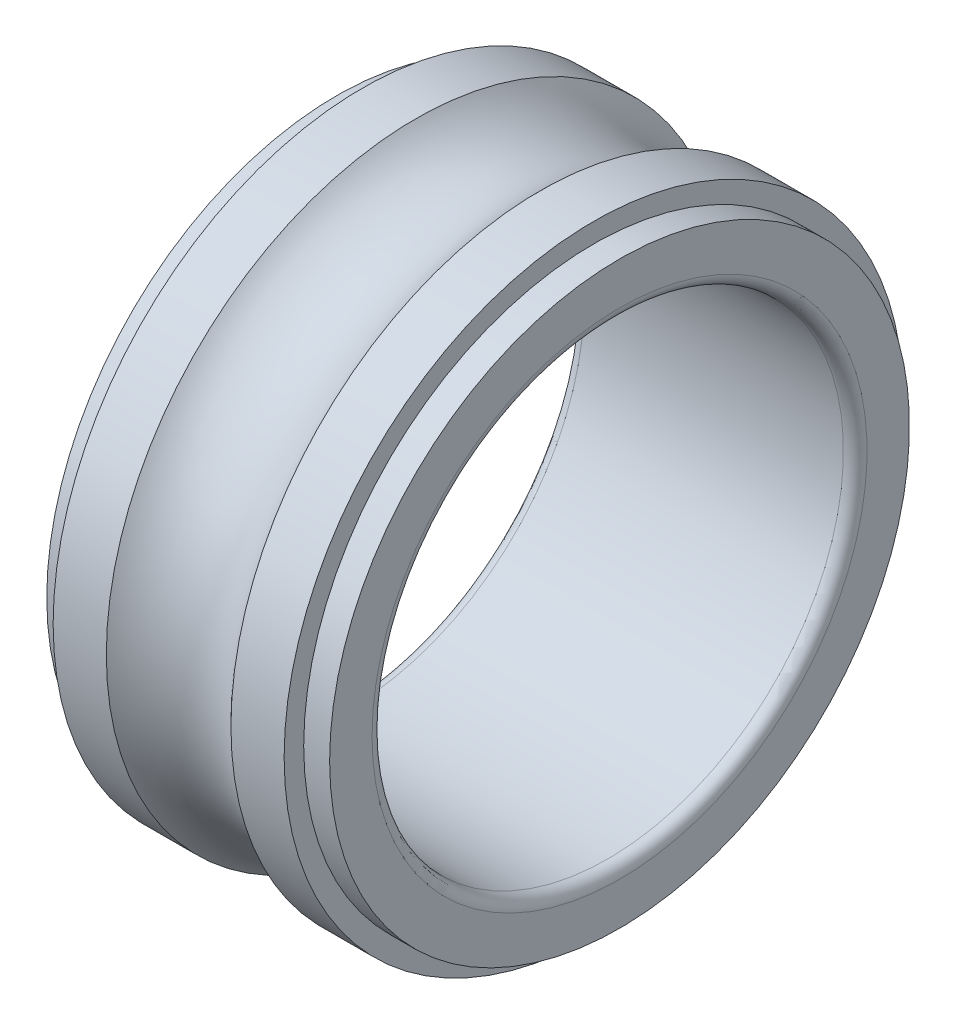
from build123d import *


with BuildPart() as part:
    # Esquisse1 → Base-R_volution (revolve)
    with BuildSketch(Plane.XY, mode=Mode.PRIVATE) as base_r_volution_sk:
        with BuildLine():
            Line((2.643028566, 13.13), (4.9, 13.13))
            Line((4.9, 13.13), (4.9, 12.3))
            Line((4.9, 12.3), (6, 12.3))
            Line((6, 12.3), (6, 10.5))
            ThreePointArc((6, 10.5), (5.853553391, 10.146446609), (5.5, 10))
            Line((5.5, 10), (-5.5, 10))
            ThreePointArc((-5.5, 10), (-5.853553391, 10.146446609), (-6, 10.5))
            Line((-6, 10.5), (-6, 12.3))
            Line((-6, 12.3), (-4.9, 12.3))
            Line((-4.9, 12.3), (-4.9, 13.13))
            Line((-4.9, 13.13), (-2.643028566, 13.13))
            ThreePointArc((-2.643028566, 13.13), (0, 11.95), (2.643028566, 13.13))
        make_face()
    revolve(base_r_volution_sk.sketch.rotate(Axis((-24.320242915, 0, 0), (1, 0, 0)), 90), axis=Axis((-24.320242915, 0, 0), (1, 0, 0)))


solid = part.part
